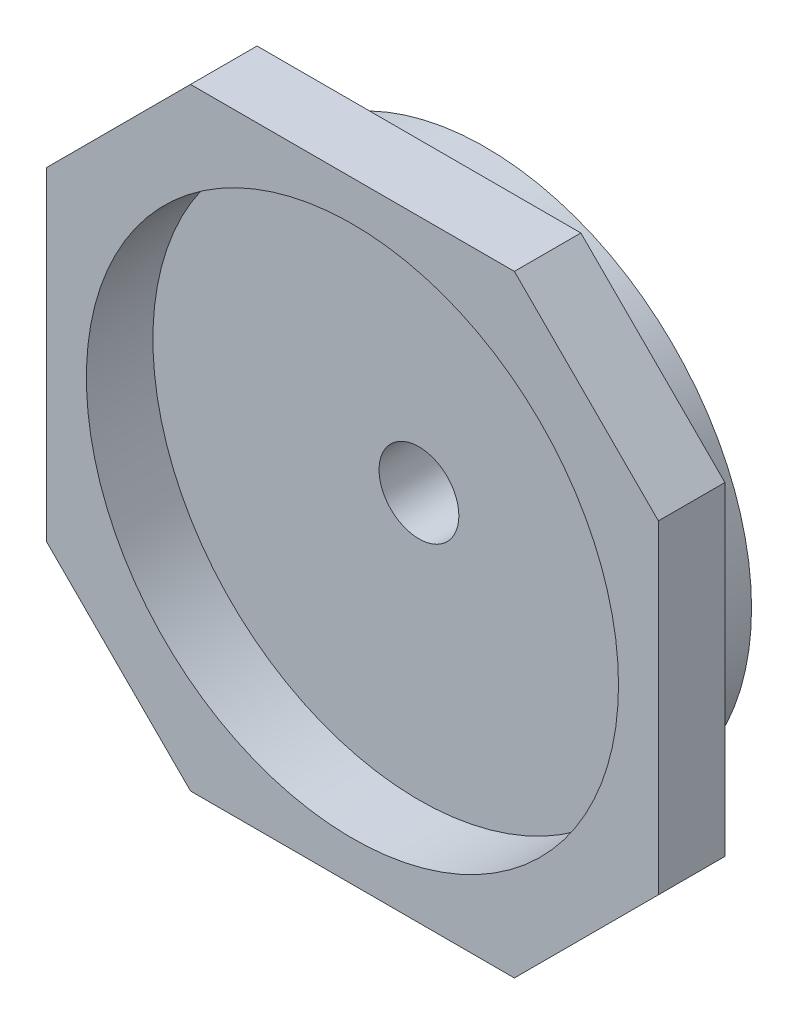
ISO-10303-21;
HEADER;
FILE_DESCRIPTION(('STEP AP214'),'2;1');
FILE_NAME('part.step','',(''),(''),'','','');
FILE_SCHEMA(('AUTOMOTIVE_DESIGN { 1 0 10303 214 1 1 1 1 }'));
ENDSEC;
DATA;
#1=APPLICATION_CONTEXT('core data for automotive mechanical design processes');
#2=APPLICATION_PROTOCOL_DEFINITION('international standard','automotive_design',2000,#1);
#3=PRODUCT_CONTEXT('',#1,'mechanical');
#4=PRODUCT('Part','Part','',(#3));
#5=PRODUCT_RELATED_PRODUCT_CATEGORY('part','',(#4));
#6=PRODUCT_DEFINITION_FORMATION('','',#4);
#7=PRODUCT_DEFINITION_CONTEXT('part definition',#1,'design');
#8=PRODUCT_DEFINITION('design','',#6,#7);
#9=PRODUCT_DEFINITION_SHAPE('','',#8);
#10=(LENGTH_UNIT() NAMED_UNIT(*) SI_UNIT(.MILLI.,.METRE.));
#11=(NAMED_UNIT(*) PLANE_ANGLE_UNIT() SI_UNIT($,.RADIAN.));
#12=(NAMED_UNIT(*) SI_UNIT($,.STERADIAN.) SOLID_ANGLE_UNIT());
#13=UNCERTAINTY_MEASURE_WITH_UNIT(LENGTH_MEASURE(1.E-05),#10,'distance_accuracy_value','');
#14=(GEOMETRIC_REPRESENTATION_CONTEXT(3) GLOBAL_UNCERTAINTY_ASSIGNED_CONTEXT((#13)) GLOBAL_UNIT_ASSIGNED_CONTEXT((#10,
#11,#12)) REPRESENTATION_CONTEXT('',''));
#15=CARTESIAN_POINT('',(0.,0.,0.));
#16=DIRECTION('',(0.,0.,1.));
#17=DIRECTION('',(1.,0.,0.));
#18=AXIS2_PLACEMENT_3D('',#15,#16,#17);
#19=CARTESIAN_POINT('',(-2.50000000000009,0.,25.));
#20=DIRECTION('',(1.,0.,0.));
#21=DIRECTION('',(0.,0.,-1.));
#22=AXIS2_PLACEMENT_3D('',#19,#20,#21);
#23=PLANE('',#22);
#24=DIRECTION('',(0.,-1.,0.));
#25=VECTOR('',#24,1.);
#26=CARTESIAN_POINT('',(-2.50000000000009,0.,0.));
#27=LINE('',#26,#25);
#28=CARTESIAN_POINT('',(-2.50000000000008,119.357864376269,0.));
#29=VERTEX_POINT('',#28);
#30=CARTESIAN_POINT('',(-2.50000000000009,-2.3578643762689,0.));
#31=VERTEX_POINT('',#30);
#32=EDGE_CURVE('E143',#29,#31,#27,.T.);
#33=ORIENTED_EDGE('',*,*,#32,.T.);
#34=DIRECTION('',(0.,0.,-1.));
#35=VECTOR('',#34,1.);
#36=CARTESIAN_POINT('',(-2.50000000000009,-2.3578643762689,25.));
#37=LINE('',#36,#35);
#38=CARTESIAN_POINT('',(-2.50000000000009,-2.3578643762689,25.));
#39=VERTEX_POINT('',#38);
#40=EDGE_CURVE('E12',#39,#31,#37,.T.);
#41=ORIENTED_EDGE('',*,*,#40,.F.);
#42=DIRECTION('',(0.,-1.,0.));
#43=VECTOR('',#42,1.);
#44=CARTESIAN_POINT('',(-2.50000000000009,0.,25.));
#45=LINE('',#44,#43);
#46=CARTESIAN_POINT('',(-2.50000000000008,119.357864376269,25.));
#47=VERTEX_POINT('',#46);
#48=EDGE_CURVE('E189',#47,#39,#45,.T.);
#49=ORIENTED_EDGE('',*,*,#48,.F.);
#50=DIRECTION('',(0.,0.,-1.));
#51=VECTOR('',#50,1.);
#52=CARTESIAN_POINT('',(-2.50000000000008,119.357864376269,25.));
#53=LINE('',#52,#51);
#54=EDGE_CURVE('E60',#47,#29,#53,.T.);
#55=ORIENTED_EDGE('',*,*,#54,.T.);
#56=EDGE_LOOP('',(#33,#41,#49,#55));
#57=FACE_BOUND('',#56,.T.);
#58=ADVANCED_FACE('F43',(#57),#23,.F.);
#59=CARTESIAN_POINT('',(-2.4289321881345,-2.4289321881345,25.));
#60=DIRECTION('',(0.707106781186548,0.707106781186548,0.));
#61=DIRECTION('',(-0.707106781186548,0.707106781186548,0.));
#62=AXIS2_PLACEMENT_3D('',#59,#60,#61);
#63=PLANE('',#62);
#64=DIRECTION('',(0.707106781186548,-0.707106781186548,0.));
#65=VECTOR('',#64,1.);
#66=CARTESIAN_POINT('',(-2.4289321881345,-2.4289321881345,0.));
#67=LINE('',#66,#65);
#68=CARTESIAN_POINT('',(51.642135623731,-56.5,0.));
#69=VERTEX_POINT('',#68);
#70=EDGE_CURVE('E145',#31,#69,#67,.T.);
#71=ORIENTED_EDGE('',*,*,#70,.T.);
#72=DIRECTION('',(0.,0.,-1.));
#73=VECTOR('',#72,1.);
#74=CARTESIAN_POINT('',(51.642135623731,-56.5,25.));
#75=LINE('',#74,#73);
#76=CARTESIAN_POINT('',(51.642135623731,-56.5,25.));
#77=VERTEX_POINT('',#76);
#78=EDGE_CURVE('E52',#77,#69,#75,.T.);
#79=ORIENTED_EDGE('',*,*,#78,.F.);
#80=DIRECTION('',(0.707106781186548,-0.707106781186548,0.));
#81=VECTOR('',#80,1.);
#82=CARTESIAN_POINT('',(-2.4289321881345,-2.4289321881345,25.));
#83=LINE('',#82,#81);
#84=EDGE_CURVE('E98',#39,#77,#83,.T.);
#85=ORIENTED_EDGE('',*,*,#84,.F.);
#86=ORIENTED_EDGE('',*,*,#40,.T.);
#87=EDGE_LOOP('',(#71,#79,#85,#86));
#88=FACE_BOUND('',#87,.T.);
#89=ADVANCED_FACE('F207',(#88),#63,.F.);
#90=CARTESIAN_POINT('',(0.,-56.5,25.));
#91=DIRECTION('',(0.,1.,0.));
#92=DIRECTION('',(0.,0.,1.));
#93=AXIS2_PLACEMENT_3D('',#90,#91,#92);
#94=PLANE('',#93);
#95=DIRECTION('',(1.,0.,0.));
#96=VECTOR('',#95,1.);
#97=CARTESIAN_POINT('',(0.,-56.5,0.));
#98=LINE('',#97,#96);
#99=CARTESIAN_POINT('',(173.357864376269,-56.5,0.));
#100=VERTEX_POINT('',#99);
#101=EDGE_CURVE('E147',#69,#100,#98,.T.);
#102=ORIENTED_EDGE('',*,*,#101,.T.);
#103=DIRECTION('',(0.,0.,-1.));
#104=VECTOR('',#103,1.);
#105=CARTESIAN_POINT('',(173.357864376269,-56.5,25.));
#106=LINE('',#105,#104);
#107=CARTESIAN_POINT('',(173.357864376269,-56.5,25.));
#108=VERTEX_POINT('',#107);
#109=EDGE_CURVE('E167',#108,#100,#106,.T.);
#110=ORIENTED_EDGE('',*,*,#109,.F.);
#111=DIRECTION('',(1.,0.,0.));
#112=VECTOR('',#111,1.);
#113=CARTESIAN_POINT('',(0.,-56.5,25.));
#114=LINE('',#113,#112);
#115=EDGE_CURVE('E175',#77,#108,#114,.T.);
#116=ORIENTED_EDGE('',*,*,#115,.F.);
#117=ORIENTED_EDGE('',*,*,#78,.T.);
#118=EDGE_LOOP('',(#102,#110,#116,#117));
#119=FACE_BOUND('',#118,.T.);
#120=ADVANCED_FACE('F173',(#119),#94,.F.);
#121=CARTESIAN_POINT('',(114.928932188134,-114.928932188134,25.));
#122=DIRECTION('',(-0.707106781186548,0.707106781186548,0.));
#123=DIRECTION('',(-0.707106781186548,-0.707106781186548,0.));
#124=AXIS2_PLACEMENT_3D('',#121,#122,#123);
#125=PLANE('',#124);
#126=DIRECTION('',(0.707106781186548,0.707106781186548,0.));
#127=VECTOR('',#126,1.);
#128=CARTESIAN_POINT('',(114.928932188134,-114.928932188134,0.));
#129=LINE('',#128,#127);
#130=CARTESIAN_POINT('',(227.5,-2.35786437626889,0.));
#131=VERTEX_POINT('',#130);
#132=EDGE_CURVE('E149',#100,#131,#129,.T.);
#133=ORIENTED_EDGE('',*,*,#132,.T.);
#134=DIRECTION('',(0.,0.,-1.));
#135=VECTOR('',#134,1.);
#136=CARTESIAN_POINT('',(227.5,-2.35786437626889,25.));
#137=LINE('',#136,#135);
#138=CARTESIAN_POINT('',(227.5,-2.35786437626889,25.));
#139=VERTEX_POINT('',#138);
#140=EDGE_CURVE('E165',#139,#131,#137,.T.);
#141=ORIENTED_EDGE('',*,*,#140,.F.);
#142=DIRECTION('',(0.707106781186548,0.707106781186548,0.));
#143=VECTOR('',#142,1.);
#144=CARTESIAN_POINT('',(114.928932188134,-114.928932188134,25.));
#145=LINE('',#144,#143);
#146=EDGE_CURVE('E184',#108,#139,#145,.T.);
#147=ORIENTED_EDGE('',*,*,#146,.F.);
#148=ORIENTED_EDGE('',*,*,#109,.T.);
#149=EDGE_LOOP('',(#133,#141,#147,#148));
#150=FACE_BOUND('',#149,.T.);
#151=ADVANCED_FACE('F182',(#150),#125,.F.);
#152=CARTESIAN_POINT('',(227.5,0.,25.));
#153=DIRECTION('',(1.,0.,0.));
#154=DIRECTION('',(0.,0.,-1.));
#155=AXIS2_PLACEMENT_3D('',#152,#153,#154);
#156=PLANE('',#155);
#157=DIRECTION('',(0.,-1.,0.));
#158=VECTOR('',#157,1.);
#159=CARTESIAN_POINT('',(227.5,0.,0.));
#160=LINE('',#159,#158);
#161=CARTESIAN_POINT('',(227.5,119.357864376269,0.));
#162=VERTEX_POINT('',#161);
#163=EDGE_CURVE('E152',#162,#131,#160,.T.);
#164=ORIENTED_EDGE('',*,*,#163,.F.);
#165=DIRECTION('',(0.,0.,-1.));
#166=VECTOR('',#165,1.);
#167=CARTESIAN_POINT('',(227.5,119.357864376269,25.));
#168=LINE('',#167,#166);
#169=CARTESIAN_POINT('',(227.5,119.357864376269,25.));
#170=VERTEX_POINT('',#169);
#171=EDGE_CURVE('E123',#170,#162,#168,.T.);
#172=ORIENTED_EDGE('',*,*,#171,.F.);
#173=DIRECTION('',(0.,-1.,0.));
#174=VECTOR('',#173,1.);
#175=CARTESIAN_POINT('',(227.5,0.,25.));
#176=LINE('',#175,#174);
#177=EDGE_CURVE('E132',#170,#139,#176,.T.);
#178=ORIENTED_EDGE('',*,*,#177,.T.);
#179=ORIENTED_EDGE('',*,*,#140,.T.);
#180=EDGE_LOOP('',(#164,#172,#178,#179));
#181=FACE_BOUND('',#180,.T.);
#182=ADVANCED_FACE('F217',(#181),#156,.T.);
#183=CARTESIAN_POINT('',(173.428932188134,173.428932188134,25.));
#184=DIRECTION('',(0.707106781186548,0.707106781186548,0.));
#185=DIRECTION('',(-0.707106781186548,0.707106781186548,0.));
#186=AXIS2_PLACEMENT_3D('',#183,#184,#185);
#187=PLANE('',#186);
#188=DIRECTION('',(0.707106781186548,-0.707106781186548,0.));
#189=VECTOR('',#188,1.);
#190=CARTESIAN_POINT('',(173.428932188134,173.428932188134,0.));
#191=LINE('',#190,#189);
#192=CARTESIAN_POINT('',(173.357864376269,173.5,0.));
#193=VERTEX_POINT('',#192);
#194=EDGE_CURVE('E119',#193,#162,#191,.T.);
#195=ORIENTED_EDGE('',*,*,#194,.F.);
#196=DIRECTION('',(0.,0.,-1.));
#197=VECTOR('',#196,1.);
#198=CARTESIAN_POINT('',(173.357864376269,173.5,25.));
#199=LINE('',#198,#197);
#200=CARTESIAN_POINT('',(173.357864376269,173.5,25.));
#201=VERTEX_POINT('',#200);
#202=EDGE_CURVE('E114',#201,#193,#199,.T.);
#203=ORIENTED_EDGE('',*,*,#202,.F.);
#204=DIRECTION('',(0.707106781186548,-0.707106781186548,0.));
#205=VECTOR('',#204,1.);
#206=CARTESIAN_POINT('',(173.428932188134,173.428932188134,25.));
#207=LINE('',#206,#205);
#208=EDGE_CURVE('E117',#201,#170,#207,.T.);
#209=ORIENTED_EDGE('',*,*,#208,.T.);
#210=ORIENTED_EDGE('',*,*,#171,.T.);
#211=EDGE_LOOP('',(#195,#203,#209,#210));
#212=FACE_BOUND('',#211,.T.);
#213=ADVANCED_FACE('F116',(#212),#187,.T.);
#214=CARTESIAN_POINT('',(0.,173.5,25.));
#215=DIRECTION('',(0.,1.,0.));
#216=DIRECTION('',(0.,0.,1.));
#217=AXIS2_PLACEMENT_3D('',#214,#215,#216);
#218=PLANE('',#217);
#219=DIRECTION('',(1.,0.,0.));
#220=VECTOR('',#219,1.);
#221=CARTESIAN_POINT('',(0.,173.5,0.));
#222=LINE('',#221,#220);
#223=CARTESIAN_POINT('',(51.6421356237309,173.5,0.));
#224=VERTEX_POINT('',#223);
#225=EDGE_CURVE('E156',#224,#193,#222,.T.);
#226=ORIENTED_EDGE('',*,*,#225,.F.);
#227=DIRECTION('',(0.,0.,-1.));
#228=VECTOR('',#227,1.);
#229=CARTESIAN_POINT('',(51.6421356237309,173.5,25.));
#230=LINE('',#229,#228);
#231=CARTESIAN_POINT('',(51.6421356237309,173.5,25.));
#232=VERTEX_POINT('',#231);
#233=EDGE_CURVE('E86',#232,#224,#230,.T.);
#234=ORIENTED_EDGE('',*,*,#233,.F.);
#235=DIRECTION('',(1.,0.,0.));
#236=VECTOR('',#235,1.);
#237=CARTESIAN_POINT('',(0.,173.5,25.));
#238=LINE('',#237,#236);
#239=EDGE_CURVE('E130',#232,#201,#238,.T.);
#240=ORIENTED_EDGE('',*,*,#239,.T.);
#241=ORIENTED_EDGE('',*,*,#202,.T.);
#242=EDGE_LOOP('',(#226,#234,#240,#241));
#243=FACE_BOUND('',#242,.T.);
#244=ADVANCED_FACE('F134',(#243),#218,.T.);
#245=CARTESIAN_POINT('',(112.5,58.4999999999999,25.));
#246=DIRECTION('',(0.,0.,-1.));
#247=DIRECTION('',(-1.,0.,0.));
#248=AXIS2_PLACEMENT_3D('',#245,#246,#247);
#249=CYLINDRICAL_SURFACE('',#248,100.);
#250=CARTESIAN_POINT('',(112.5,58.4999999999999,25.));
#251=DIRECTION('',(0.,0.,1.));
#252=DIRECTION('',(1.,0.,0.));
#253=AXIS2_PLACEMENT_3D('',#250,#251,#252);
#254=CIRCLE('',#253,100.);
#255=CARTESIAN_POINT('',(212.5,58.4999999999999,25.));
#256=VERTEX_POINT('',#255);
#257=EDGE_CURVE('E161',#256,#256,#254,.T.);
#258=ORIENTED_EDGE('',*,*,#257,.T.);
#259=EDGE_LOOP('',(#258));
#260=FACE_BOUND('',#259,.T.);
#261=CARTESIAN_POINT('',(112.5,58.4999999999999,0.));
#262=DIRECTION('',(0.,0.,1.));
#263=DIRECTION('',(1.,0.,0.));
#264=AXIS2_PLACEMENT_3D('',#261,#262,#263);
#265=CIRCLE('',#264,100.);
#266=CARTESIAN_POINT('',(212.5,58.4999999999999,0.));
#267=VERTEX_POINT('',#266);
#268=EDGE_CURVE('E140',#267,#267,#265,.T.);
#269=ORIENTED_EDGE('',*,*,#268,.F.);
#270=EDGE_LOOP('',(#269));
#271=FACE_BOUND('',#270,.T.);
#272=ADVANCED_FACE('F45',(#260,#271),#249,.F.);
#273=CARTESIAN_POINT('',(-60.9289321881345,60.9289321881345,25.));
#274=DIRECTION('',(-0.707106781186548,0.707106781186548,0.));
#275=DIRECTION('',(-0.707106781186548,-0.707106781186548,0.));
#276=AXIS2_PLACEMENT_3D('',#273,#274,#275);
#277=PLANE('',#276);
#278=DIRECTION('',(0.707106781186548,0.707106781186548,0.));
#279=VECTOR('',#278,1.);
#280=CARTESIAN_POINT('',(-60.9289321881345,60.9289321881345,0.));
#281=LINE('',#280,#279);
#282=EDGE_CURVE('E158',#29,#224,#281,.T.);
#283=ORIENTED_EDGE('',*,*,#282,.F.);
#284=ORIENTED_EDGE('',*,*,#54,.F.);
#285=DIRECTION('',(0.707106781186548,0.707106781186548,0.));
#286=VECTOR('',#285,1.);
#287=CARTESIAN_POINT('',(-60.9289321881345,60.9289321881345,25.));
#288=LINE('',#287,#286);
#289=EDGE_CURVE('E135',#47,#232,#288,.T.);
#290=ORIENTED_EDGE('',*,*,#289,.T.);
#291=ORIENTED_EDGE('',*,*,#233,.T.);
#292=EDGE_LOOP('',(#283,#284,#290,#291));
#293=FACE_BOUND('',#292,.T.);
#294=ADVANCED_FACE('F197',(#293),#277,.T.);
#295=CARTESIAN_POINT('',(0.,0.,25.));
#296=DIRECTION('',(0.,0.,1.));
#297=DIRECTION('',(1.,0.,0.));
#298=AXIS2_PLACEMENT_3D('',#295,#296,#297);
#299=PLANE('',#298);
#300=ORIENTED_EDGE('',*,*,#257,.F.);
#301=EDGE_LOOP('',(#300));
#302=FACE_BOUND('',#301,.T.);
#303=ORIENTED_EDGE('',*,*,#48,.T.);
#304=ORIENTED_EDGE('',*,*,#84,.T.);
#305=ORIENTED_EDGE('',*,*,#115,.T.);
#306=ORIENTED_EDGE('',*,*,#146,.T.);
#307=ORIENTED_EDGE('',*,*,#177,.F.);
#308=ORIENTED_EDGE('',*,*,#208,.F.);
#309=ORIENTED_EDGE('',*,*,#239,.F.);
#310=ORIENTED_EDGE('',*,*,#289,.F.);
#311=EDGE_LOOP('',(#303,#304,#305,#306,#307,#308,#309,#310));
#312=FACE_BOUND('',#311,.T.);
#313=ADVANCED_FACE('F128',(#302,#312),#299,.T.);
#314=CARTESIAN_POINT('',(0.,0.,0.));
#315=DIRECTION('',(0.,0.,1.));
#316=DIRECTION('',(1.,0.,0.));
#317=AXIS2_PLACEMENT_3D('',#314,#315,#316);
#318=PLANE('',#317);
#319=ORIENTED_EDGE('',*,*,#268,.T.);
#320=EDGE_LOOP('',(#319));
#321=FACE_BOUND('',#320,.T.);
#322=ORIENTED_EDGE('',*,*,#32,.F.);
#323=ORIENTED_EDGE('',*,*,#282,.T.);
#324=ORIENTED_EDGE('',*,*,#225,.T.);
#325=ORIENTED_EDGE('',*,*,#194,.T.);
#326=ORIENTED_EDGE('',*,*,#163,.T.);
#327=ORIENTED_EDGE('',*,*,#132,.F.);
#328=ORIENTED_EDGE('',*,*,#101,.F.);
#329=ORIENTED_EDGE('',*,*,#70,.F.);
#330=EDGE_LOOP('',(#322,#323,#324,#325,#326,#327,#328,#329));
#331=FACE_BOUND('',#330,.T.);
#332=ADVANCED_FACE('F178',(#321,#331),#318,.F.);
#333=CLOSED_SHELL('',(#58,#89,#120,#151,#182,#213,#244,#272,#294,#313,#332));
#334=MANIFOLD_SOLID_BREP('B2',#333);
#335=CARTESIAN_POINT('',(112.5,58.4999999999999,-25.));
#336=DIRECTION('',(0.,0.,1.));
#337=DIRECTION('',(1.,0.,0.));
#338=AXIS2_PLACEMENT_3D('',#335,#336,#337);
#339=CYLINDRICAL_SURFACE('',#338,15.);
#340=CARTESIAN_POINT('',(112.5,58.4999999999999,-25.));
#341=DIRECTION('',(0.,0.,1.));
#342=DIRECTION('',(1.,0.,0.));
#343=AXIS2_PLACEMENT_3D('',#340,#341,#342);
#344=CIRCLE('',#343,15.);
#345=CARTESIAN_POINT('',(127.5,58.4999999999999,-25.));
#346=VERTEX_POINT('',#345);
#347=EDGE_CURVE('E299',#346,#346,#344,.T.);
#348=ORIENTED_EDGE('',*,*,#347,.F.);
#349=EDGE_LOOP('',(#348));
#350=FACE_BOUND('',#349,.T.);
#351=CARTESIAN_POINT('',(112.5,58.4999999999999,0.));
#352=DIRECTION('',(0.,0.,1.));
#353=DIRECTION('',(1.,0.,0.));
#354=AXIS2_PLACEMENT_3D('',#351,#352,#353);
#355=CIRCLE('',#354,15.);
#356=CARTESIAN_POINT('',(127.5,58.4999999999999,0.));
#357=VERTEX_POINT('',#356);
#358=EDGE_CURVE('E305',#357,#357,#355,.T.);
#359=ORIENTED_EDGE('',*,*,#358,.T.);
#360=EDGE_LOOP('',(#359));
#361=FACE_BOUND('',#360,.T.);
#362=ADVANCED_FACE('F292',(#350,#361),#339,.F.);
#363=CARTESIAN_POINT('',(112.5,58.4999999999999,-25.));
#364=DIRECTION('',(0.,0.,1.));
#365=DIRECTION('',(1.,0.,0.));
#366=AXIS2_PLACEMENT_3D('',#363,#364,#365);
#367=CYLINDRICAL_SURFACE('',#366,100.);
#368=CARTESIAN_POINT('',(112.5,58.4999999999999,-25.));
#369=DIRECTION('',(0.,0.,1.));
#370=DIRECTION('',(1.,0.,0.));
#371=AXIS2_PLACEMENT_3D('',#368,#369,#370);
#372=CIRCLE('',#371,100.);
#373=CARTESIAN_POINT('',(212.5,58.4999999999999,-25.));
#374=VERTEX_POINT('',#373);
#375=EDGE_CURVE('E42',#374,#374,#372,.T.);
#376=ORIENTED_EDGE('',*,*,#375,.T.);
#377=EDGE_LOOP('',(#376));
#378=FACE_BOUND('',#377,.T.);
#379=CARTESIAN_POINT('',(112.5,58.4999999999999,0.));
#380=DIRECTION('',(0.,0.,1.));
#381=DIRECTION('',(1.,0.,0.));
#382=AXIS2_PLACEMENT_3D('',#379,#380,#381);
#383=CIRCLE('',#382,100.);
#384=CARTESIAN_POINT('',(212.5,58.4999999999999,0.));
#385=VERTEX_POINT('',#384);
#386=EDGE_CURVE('E295',#385,#385,#383,.T.);
#387=ORIENTED_EDGE('',*,*,#386,.F.);
#388=EDGE_LOOP('',(#387));
#389=FACE_BOUND('',#388,.T.);
#390=ADVANCED_FACE('F314',(#378,#389),#367,.T.);
#391=CARTESIAN_POINT('',(0.,0.,-25.));
#392=DIRECTION('',(0.,0.,1.));
#393=DIRECTION('',(1.,0.,0.));
#394=AXIS2_PLACEMENT_3D('',#391,#392,#393);
#395=PLANE('',#394);
#396=ORIENTED_EDGE('',*,*,#347,.T.);
#397=EDGE_LOOP('',(#396));
#398=FACE_BOUND('',#397,.T.);
#399=ORIENTED_EDGE('',*,*,#375,.F.);
#400=EDGE_LOOP('',(#399));
#401=FACE_BOUND('',#400,.T.);
#402=ADVANCED_FACE('F316',(#398,#401),#395,.F.);
#403=CARTESIAN_POINT('',(0.,0.,0.));
#404=DIRECTION('',(0.,0.,1.));
#405=DIRECTION('',(1.,0.,0.));
#406=AXIS2_PLACEMENT_3D('',#403,#404,#405);
#407=PLANE('',#406);
#408=ORIENTED_EDGE('',*,*,#358,.F.);
#409=EDGE_LOOP('',(#408));
#410=FACE_BOUND('',#409,.T.);
#411=ORIENTED_EDGE('',*,*,#386,.T.);
#412=EDGE_LOOP('',(#411));
#413=FACE_BOUND('',#412,.T.);
#414=ADVANCED_FACE('F312',(#410,#413),#407,.T.);
#415=CLOSED_SHELL('',(#362,#390,#402,#414));
#416=MANIFOLD_SOLID_BREP('B6',#415);
#417=ADVANCED_BREP_SHAPE_REPRESENTATION('',(#18,#334,#416),#14);
#418=SHAPE_DEFINITION_REPRESENTATION(#9,#417);
ENDSEC;
END-ISO-10303-21;
